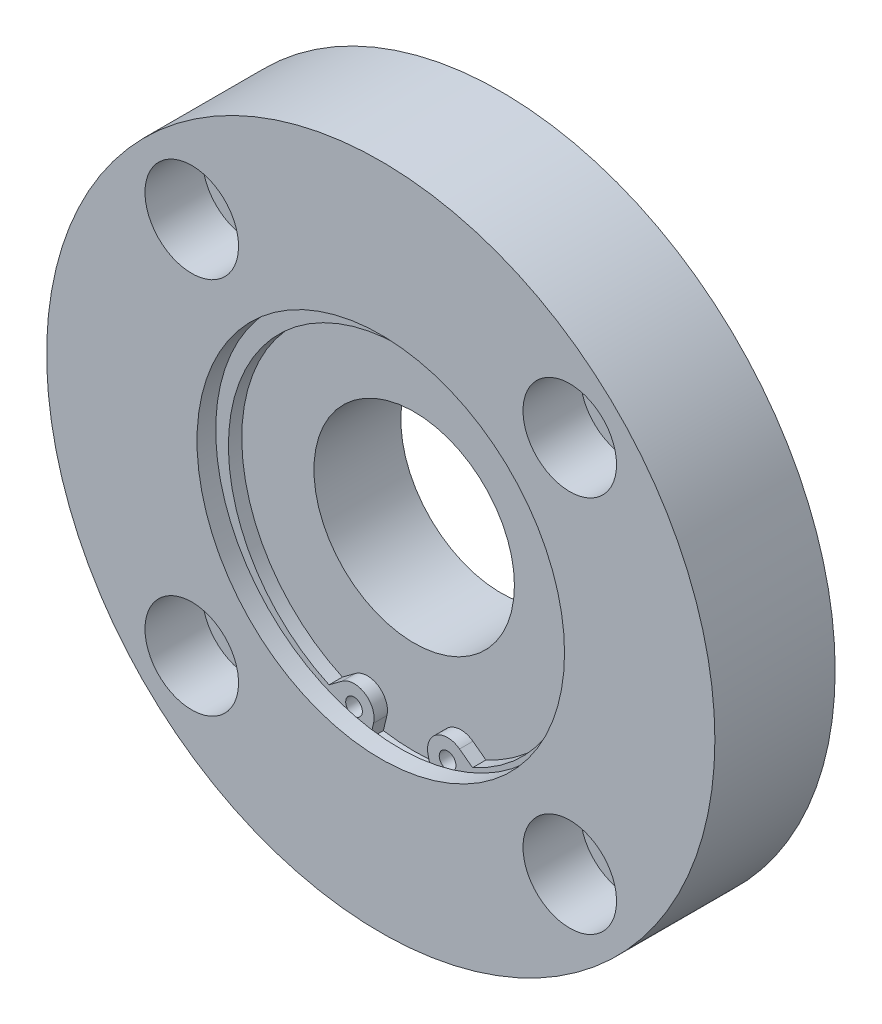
ISO-10303-21;
HEADER;
FILE_DESCRIPTION(('STEP AP214'),'2;1');
FILE_NAME('part.step','',(''),(''),'','','');
FILE_SCHEMA(('AUTOMOTIVE_DESIGN { 1 0 10303 214 1 1 1 1 }'));
ENDSEC;
DATA;
#1=APPLICATION_CONTEXT('core data for automotive mechanical design processes');
#2=APPLICATION_PROTOCOL_DEFINITION('international standard','automotive_design',2000,#1);
#3=PRODUCT_CONTEXT('',#1,'mechanical');
#4=PRODUCT('Part','Part','',(#3));
#5=PRODUCT_RELATED_PRODUCT_CATEGORY('part','',(#4));
#6=PRODUCT_DEFINITION_FORMATION('','',#4);
#7=PRODUCT_DEFINITION_CONTEXT('part definition',#1,'design');
#8=PRODUCT_DEFINITION('design','',#6,#7);
#9=PRODUCT_DEFINITION_SHAPE('','',#8);
#10=(LENGTH_UNIT() NAMED_UNIT(*) SI_UNIT(.MILLI.,.METRE.));
#11=(NAMED_UNIT(*) PLANE_ANGLE_UNIT() SI_UNIT($,.RADIAN.));
#12=(NAMED_UNIT(*) SI_UNIT($,.STERADIAN.) SOLID_ANGLE_UNIT());
#13=UNCERTAINTY_MEASURE_WITH_UNIT(LENGTH_MEASURE(1.E-05),#10,'distance_accuracy_value','');
#14=(GEOMETRIC_REPRESENTATION_CONTEXT(3) GLOBAL_UNCERTAINTY_ASSIGNED_CONTEXT((#13)) GLOBAL_UNIT_ASSIGNED_CONTEXT((#10,
#11,#12)) REPRESENTATION_CONTEXT('',''));
#15=CARTESIAN_POINT('',(0.,0.,0.));
#16=DIRECTION('',(0.,0.,1.));
#17=DIRECTION('',(1.,0.,0.));
#18=AXIS2_PLACEMENT_3D('',#15,#16,#17);
#19=CARTESIAN_POINT('',(0.,0.,13.));
#20=DIRECTION('',(0.,0.,1.));
#21=DIRECTION('',(1.,0.,0.));
#22=AXIS2_PLACEMENT_3D('',#19,#20,#21);
#23=PLANE('',#22);
#24=CARTESIAN_POINT('',(7.,-25.7166112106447,13.));
#25=DIRECTION('',(0.,0.,1.));
#26=DIRECTION('',(1.,0.,0.));
#27=AXIS2_PLACEMENT_3D('',#24,#25,#26);
#28=CIRCLE('',#27,1.25);
#29=CARTESIAN_POINT('',(8.25,-25.7166112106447,13.));
#30=VERTEX_POINT('',#29);
#31=EDGE_CURVE('E137',#30,#30,#28,.T.);
#32=ORIENTED_EDGE('',*,*,#31,.T.);
#33=EDGE_LOOP('',(#32));
#34=FACE_BOUND('',#33,.T.);
#35=ADVANCED_FACE('F14',(#34),#23,.T.);
#36=CARTESIAN_POINT('',(-7.,-25.7166112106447,13.));
#37=DIRECTION('',(0.,0.,-1.));
#38=DIRECTION('',(1.,0.,0.));
#39=AXIS2_PLACEMENT_3D('',#36,#37,#38);
#40=CIRCLE('',#39,1.25);
#41=CARTESIAN_POINT('',(-5.75,-25.7166112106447,13.));
#42=VERTEX_POINT('',#41);
#43=EDGE_CURVE('E136',#42,#42,#40,.T.);
#44=ORIENTED_EDGE('',*,*,#43,.F.);
#45=EDGE_LOOP('',(#44));
#46=FACE_BOUND('',#45,.T.);
#47=ADVANCED_FACE('F296',(#46),#23,.T.);
#48=CARTESIAN_POINT('',(28.2842712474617,28.2842712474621,0.));
#49=DIRECTION('',(0.,0.,1.));
#50=DIRECTION('',(1.,0.,0.));
#51=AXIS2_PLACEMENT_3D('',#48,#49,#50);
#52=CYLINDRICAL_SURFACE('',#51,5.);
#53=CARTESIAN_POINT('',(28.2842712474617,28.2842712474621,0.));
#54=DIRECTION('',(0.,0.,1.));
#55=DIRECTION('',(1.,0.,0.));
#56=AXIS2_PLACEMENT_3D('',#53,#54,#55);
#57=CIRCLE('',#56,5.);
#58=CARTESIAN_POINT('',(33.2842712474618,28.2842712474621,0.));
#59=VERTEX_POINT('',#58);
#60=EDGE_CURVE('E249',#59,#59,#57,.T.);
#61=ORIENTED_EDGE('',*,*,#60,.F.);
#62=EDGE_LOOP('',(#61));
#63=FACE_BOUND('',#62,.T.);
#64=CARTESIAN_POINT('',(28.2842712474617,28.2842712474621,9.4));
#65=DIRECTION('',(0.,0.,1.));
#66=DIRECTION('',(1.,0.,0.));
#67=AXIS2_PLACEMENT_3D('',#64,#65,#66);
#68=CIRCLE('',#67,5.);
#69=CARTESIAN_POINT('',(33.2842712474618,28.2842712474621,9.4));
#70=VERTEX_POINT('',#69);
#71=EDGE_CURVE('E248',#70,#70,#68,.F.);
#72=ORIENTED_EDGE('',*,*,#71,.F.);
#73=EDGE_LOOP('',(#72));
#74=FACE_BOUND('',#73,.T.);
#75=ADVANCED_FACE('F304',(#63,#74),#52,.F.);
#76=CARTESIAN_POINT('',(28.2842712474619,-28.2842712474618,0.));
#77=DIRECTION('',(0.,0.,1.));
#78=DIRECTION('',(1.,0.,0.));
#79=AXIS2_PLACEMENT_3D('',#76,#77,#78);
#80=CYLINDRICAL_SURFACE('',#79,5.);
#81=CARTESIAN_POINT('',(28.2842712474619,-28.2842712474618,0.));
#82=DIRECTION('',(0.,0.,1.));
#83=DIRECTION('',(0.,-1.,0.));
#84=AXIS2_PLACEMENT_3D('',#81,#82,#83);
#85=CIRCLE('',#84,5.);
#86=CARTESIAN_POINT('',(28.2842712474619,-33.2842712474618,0.));
#87=VERTEX_POINT('',#86);
#88=EDGE_CURVE('E239',#87,#87,#85,.T.);
#89=ORIENTED_EDGE('',*,*,#88,.F.);
#90=EDGE_LOOP('',(#89));
#91=FACE_BOUND('',#90,.T.);
#92=CARTESIAN_POINT('',(28.2842712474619,-28.2842712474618,9.4));
#93=DIRECTION('',(0.,0.,1.));
#94=DIRECTION('',(1.,0.,0.));
#95=AXIS2_PLACEMENT_3D('',#92,#93,#94);
#96=CIRCLE('',#95,5.);
#97=CARTESIAN_POINT('',(33.284271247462,-28.2842712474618,9.4));
#98=VERTEX_POINT('',#97);
#99=EDGE_CURVE('E232',#98,#98,#96,.F.);
#100=ORIENTED_EDGE('',*,*,#99,.F.);
#101=EDGE_LOOP('',(#100));
#102=FACE_BOUND('',#101,.T.);
#103=ADVANCED_FACE('F630',(#91,#102),#80,.F.);
#104=CARTESIAN_POINT('',(-28.2842712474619,-28.2842712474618,0.));
#105=DIRECTION('',(0.,0.,1.));
#106=DIRECTION('',(1.,0.,0.));
#107=AXIS2_PLACEMENT_3D('',#104,#105,#106);
#108=CYLINDRICAL_SURFACE('',#107,5.);
#109=CARTESIAN_POINT('',(-28.2842712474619,-28.2842712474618,0.));
#110=DIRECTION('',(0.,0.,1.));
#111=DIRECTION('',(-1.,0.,0.));
#112=AXIS2_PLACEMENT_3D('',#109,#110,#111);
#113=CIRCLE('',#112,5.);
#114=CARTESIAN_POINT('',(-33.284271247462,-28.2842712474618,0.));
#115=VERTEX_POINT('',#114);
#116=EDGE_CURVE('E236',#115,#115,#113,.T.);
#117=ORIENTED_EDGE('',*,*,#116,.F.);
#118=EDGE_LOOP('',(#117));
#119=FACE_BOUND('',#118,.T.);
#120=CARTESIAN_POINT('',(-28.2842712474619,-28.2842712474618,9.4));
#121=DIRECTION('',(0.,0.,1.));
#122=DIRECTION('',(1.,0.,0.));
#123=AXIS2_PLACEMENT_3D('',#120,#121,#122);
#124=CIRCLE('',#123,5.);
#125=CARTESIAN_POINT('',(-23.2842712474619,-28.2842712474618,9.4));
#126=VERTEX_POINT('',#125);
#127=EDGE_CURVE('E225',#126,#126,#124,.F.);
#128=ORIENTED_EDGE('',*,*,#127,.F.);
#129=EDGE_LOOP('',(#128));
#130=FACE_BOUND('',#129,.T.);
#131=ADVANCED_FACE('F620',(#119,#130),#108,.F.);
#132=CARTESIAN_POINT('',(-28.2842712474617,28.2842712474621,0.));
#133=DIRECTION('',(0.,0.,1.));
#134=DIRECTION('',(1.,0.,0.));
#135=AXIS2_PLACEMENT_3D('',#132,#133,#134);
#136=CYLINDRICAL_SURFACE('',#135,5.);
#137=CARTESIAN_POINT('',(-28.2842712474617,28.2842712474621,0.));
#138=DIRECTION('',(0.,0.,1.));
#139=DIRECTION('',(0.,1.,0.));
#140=AXIS2_PLACEMENT_3D('',#137,#138,#139);
#141=CIRCLE('',#140,5.);
#142=CARTESIAN_POINT('',(-28.2842712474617,33.2842712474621,0.));
#143=VERTEX_POINT('',#142);
#144=EDGE_CURVE('E233',#143,#143,#141,.T.);
#145=ORIENTED_EDGE('',*,*,#144,.F.);
#146=EDGE_LOOP('',(#145));
#147=FACE_BOUND('',#146,.T.);
#148=CARTESIAN_POINT('',(-28.2842712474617,28.2842712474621,9.4));
#149=DIRECTION('',(0.,0.,1.));
#150=DIRECTION('',(1.,0.,0.));
#151=AXIS2_PLACEMENT_3D('',#148,#149,#150);
#152=CIRCLE('',#151,5.);
#153=CARTESIAN_POINT('',(-23.2842712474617,28.2842712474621,9.4));
#154=VERTEX_POINT('',#153);
#155=EDGE_CURVE('E218',#154,#154,#152,.F.);
#156=ORIENTED_EDGE('',*,*,#155,.F.);
#157=EDGE_LOOP('',(#156));
#158=FACE_BOUND('',#157,.T.);
#159=ADVANCED_FACE('F611',(#147,#158),#136,.F.);
#160=CARTESIAN_POINT('',(0.,0.,0.));
#161=DIRECTION('',(0.,0.,1.));
#162=DIRECTION('',(1.,0.,0.));
#163=AXIS2_PLACEMENT_3D('',#160,#161,#162);
#164=PLANE('',#163);
#165=ORIENTED_EDGE('',*,*,#144,.T.);
#166=EDGE_LOOP('',(#165));
#167=FACE_BOUND('',#166,.T.);
#168=ORIENTED_EDGE('',*,*,#116,.T.);
#169=EDGE_LOOP('',(#168));
#170=FACE_BOUND('',#169,.T.);
#171=ORIENTED_EDGE('',*,*,#88,.T.);
#172=EDGE_LOOP('',(#171));
#173=FACE_BOUND('',#172,.T.);
#174=ORIENTED_EDGE('',*,*,#60,.T.);
#175=EDGE_LOOP('',(#174));
#176=FACE_BOUND('',#175,.T.);
#177=CARTESIAN_POINT('',(0.,0.,0.));
#178=DIRECTION('',(0.,0.,1.));
#179=DIRECTION('',(1.,0.,0.));
#180=AXIS2_PLACEMENT_3D('',#177,#178,#179);
#181=CIRCLE('',#180,50.);
#182=CARTESIAN_POINT('',(50.,0.,0.));
#183=VERTEX_POINT('',#182);
#184=EDGE_CURVE('E255',#183,#183,#181,.T.);
#185=ORIENTED_EDGE('',*,*,#184,.F.);
#186=EDGE_LOOP('',(#185));
#187=FACE_BOUND('',#186,.T.);
#188=CARTESIAN_POINT('',(0.,0.,0.));
#189=DIRECTION('',(0.,0.,-1.));
#190=DIRECTION('',(-1.,0.,0.));
#191=AXIS2_PLACEMENT_3D('',#188,#189,#190);
#192=CIRCLE('',#191,31.);
#193=CARTESIAN_POINT('',(-31.,0.,0.));
#194=VERTEX_POINT('',#193);
#195=EDGE_CURVE('E147',#194,#194,#192,.T.);
#196=ORIENTED_EDGE('',*,*,#195,.F.);
#197=EDGE_LOOP('',(#196));
#198=FACE_BOUND('',#197,.T.);
#199=ADVANCED_FACE('F292',(#167,#170,#173,#176,#187,#198),#164,.F.);
#200=CARTESIAN_POINT('',(28.2842712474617,28.2842712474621,9.4));
#201=DIRECTION('',(0.,0.,1.));
#202=DIRECTION('',(1.,0.,0.));
#203=AXIS2_PLACEMENT_3D('',#200,#201,#202);
#204=PLANE('',#203);
#205=CARTESIAN_POINT('',(28.2842712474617,28.2842712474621,9.4));
#206=DIRECTION('',(0.,0.,1.));
#207=DIRECTION('',(1.,0.,0.));
#208=AXIS2_PLACEMENT_3D('',#205,#206,#207);
#209=CIRCLE('',#208,7.);
#210=CARTESIAN_POINT('',(35.2842712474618,28.2842712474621,9.4));
#211=VERTEX_POINT('',#210);
#212=EDGE_CURVE('E245',#211,#211,#209,.T.);
#213=ORIENTED_EDGE('',*,*,#212,.T.);
#214=EDGE_LOOP('',(#213));
#215=FACE_BOUND('',#214,.T.);
#216=ORIENTED_EDGE('',*,*,#71,.T.);
#217=EDGE_LOOP('',(#216));
#218=FACE_BOUND('',#217,.T.);
#219=ADVANCED_FACE('F592',(#215,#218),#204,.T.);
#220=CARTESIAN_POINT('',(28.2842712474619,-28.2842712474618,9.4));
#221=DIRECTION('',(0.,0.,1.));
#222=DIRECTION('',(0.,-1.,0.));
#223=AXIS2_PLACEMENT_3D('',#220,#221,#222);
#224=PLANE('',#223);
#225=CARTESIAN_POINT('',(28.2842712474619,-28.2842712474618,9.4));
#226=DIRECTION('',(0.,0.,1.));
#227=DIRECTION('',(0.,-1.,0.));
#228=AXIS2_PLACEMENT_3D('',#225,#226,#227);
#229=CIRCLE('',#228,7.);
#230=CARTESIAN_POINT('',(28.2842712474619,-35.2842712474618,9.4));
#231=VERTEX_POINT('',#230);
#232=EDGE_CURVE('E229',#231,#231,#229,.T.);
#233=ORIENTED_EDGE('',*,*,#232,.T.);
#234=EDGE_LOOP('',(#233));
#235=FACE_BOUND('',#234,.T.);
#236=ORIENTED_EDGE('',*,*,#99,.T.);
#237=EDGE_LOOP('',(#236));
#238=FACE_BOUND('',#237,.T.);
#239=ADVANCED_FACE('F582',(#235,#238),#224,.T.);
#240=CARTESIAN_POINT('',(-28.2842712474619,-28.2842712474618,9.4));
#241=DIRECTION('',(0.,0.,1.));
#242=DIRECTION('',(-1.,0.,0.));
#243=AXIS2_PLACEMENT_3D('',#240,#241,#242);
#244=PLANE('',#243);
#245=CARTESIAN_POINT('',(-28.2842712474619,-28.2842712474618,9.4));
#246=DIRECTION('',(0.,0.,1.));
#247=DIRECTION('',(-1.,0.,0.));
#248=AXIS2_PLACEMENT_3D('',#245,#246,#247);
#249=CIRCLE('',#248,7.);
#250=CARTESIAN_POINT('',(-35.284271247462,-28.2842712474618,9.4));
#251=VERTEX_POINT('',#250);
#252=EDGE_CURVE('E222',#251,#251,#249,.T.);
#253=ORIENTED_EDGE('',*,*,#252,.T.);
#254=EDGE_LOOP('',(#253));
#255=FACE_BOUND('',#254,.T.);
#256=ORIENTED_EDGE('',*,*,#127,.T.);
#257=EDGE_LOOP('',(#256));
#258=FACE_BOUND('',#257,.T.);
#259=ADVANCED_FACE('F572',(#255,#258),#244,.T.);
#260=CARTESIAN_POINT('',(-28.2842712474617,28.2842712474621,9.4));
#261=DIRECTION('',(0.,0.,1.));
#262=DIRECTION('',(0.,1.,0.));
#263=AXIS2_PLACEMENT_3D('',#260,#261,#262);
#264=PLANE('',#263);
#265=CARTESIAN_POINT('',(-28.2842712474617,28.2842712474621,9.4));
#266=DIRECTION('',(0.,0.,1.));
#267=DIRECTION('',(0.,1.,0.));
#268=AXIS2_PLACEMENT_3D('',#265,#266,#267);
#269=CIRCLE('',#268,7.);
#270=CARTESIAN_POINT('',(-28.2842712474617,35.2842712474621,9.4));
#271=VERTEX_POINT('',#270);
#272=EDGE_CURVE('E215',#271,#271,#269,.T.);
#273=ORIENTED_EDGE('',*,*,#272,.T.);
#274=EDGE_LOOP('',(#273));
#275=FACE_BOUND('',#274,.T.);
#276=ORIENTED_EDGE('',*,*,#155,.T.);
#277=EDGE_LOOP('',(#276));
#278=FACE_BOUND('',#277,.T.);
#279=ADVANCED_FACE('F563',(#275,#278),#264,.T.);
#280=CARTESIAN_POINT('',(0.,0.,-5.));
#281=DIRECTION('',(0.,0.,1.));
#282=DIRECTION('',(1.,0.,0.));
#283=AXIS2_PLACEMENT_3D('',#280,#281,#282);
#284=CYLINDRICAL_SURFACE('',#283,31.);
#285=CARTESIAN_POINT('',(0.,0.,-5.));
#286=DIRECTION('',(0.,0.,-1.));
#287=DIRECTION('',(-1.,0.,0.));
#288=AXIS2_PLACEMENT_3D('',#285,#286,#287);
#289=CIRCLE('',#288,31.);
#290=CARTESIAN_POINT('',(-31.,0.,-5.));
#291=VERTEX_POINT('',#290);
#292=EDGE_CURVE('E202',#291,#291,#289,.T.);
#293=ORIENTED_EDGE('',*,*,#292,.F.);
#294=EDGE_LOOP('',(#293));
#295=FACE_BOUND('',#294,.T.);
#296=ORIENTED_EDGE('',*,*,#195,.T.);
#297=EDGE_LOOP('',(#296));
#298=FACE_BOUND('',#297,.T.);
#299=ADVANCED_FACE('F554',(#295,#298),#284,.T.);
#300=CARTESIAN_POINT('',(0.,0.,18.));
#301=DIRECTION('',(0.,0.,-1.));
#302=DIRECTION('',(-1.,0.,0.));
#303=AXIS2_PLACEMENT_3D('',#300,#301,#302);
#304=CYLINDRICAL_SURFACE('',#303,50.);
#305=CARTESIAN_POINT('',(0.,0.,18.));
#306=DIRECTION('',(0.,0.,1.));
#307=DIRECTION('',(1.,0.,0.));
#308=AXIS2_PLACEMENT_3D('',#305,#306,#307);
#309=CIRCLE('',#308,50.);
#310=CARTESIAN_POINT('',(50.,0.,18.));
#311=VERTEX_POINT('',#310);
#312=EDGE_CURVE('E205',#311,#311,#309,.T.);
#313=ORIENTED_EDGE('',*,*,#312,.F.);
#314=EDGE_LOOP('',(#313));
#315=FACE_BOUND('',#314,.T.);
#316=ORIENTED_EDGE('',*,*,#184,.T.);
#317=EDGE_LOOP('',(#316));
#318=FACE_BOUND('',#317,.T.);
#319=ADVANCED_FACE('F16',(#315,#318),#304,.T.);
#320=CARTESIAN_POINT('',(28.2842712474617,28.2842712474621,9.4));
#321=DIRECTION('',(0.,0.,1.));
#322=DIRECTION('',(1.,0.,0.));
#323=AXIS2_PLACEMENT_3D('',#320,#321,#322);
#324=CYLINDRICAL_SURFACE('',#323,7.);
#325=ORIENTED_EDGE('',*,*,#212,.F.);
#326=EDGE_LOOP('',(#325));
#327=FACE_BOUND('',#326,.T.);
#328=CARTESIAN_POINT('',(28.2842712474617,28.2842712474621,18.));
#329=DIRECTION('',(0.,0.,1.));
#330=DIRECTION('',(1.,0.,0.));
#331=AXIS2_PLACEMENT_3D('',#328,#329,#330);
#332=CIRCLE('',#331,7.);
#333=CARTESIAN_POINT('',(35.2842712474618,28.2842712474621,18.));
#334=VERTEX_POINT('',#333);
#335=EDGE_CURVE('E242',#334,#334,#332,.T.);
#336=ORIENTED_EDGE('',*,*,#335,.T.);
#337=EDGE_LOOP('',(#336));
#338=FACE_BOUND('',#337,.T.);
#339=ADVANCED_FACE('F535',(#327,#338),#324,.F.);
#340=CARTESIAN_POINT('',(28.2842712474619,-28.2842712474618,9.4));
#341=DIRECTION('',(0.,0.,1.));
#342=DIRECTION('',(1.,0.,0.));
#343=AXIS2_PLACEMENT_3D('',#340,#341,#342);
#344=CYLINDRICAL_SURFACE('',#343,7.);
#345=ORIENTED_EDGE('',*,*,#232,.F.);
#346=EDGE_LOOP('',(#345));
#347=FACE_BOUND('',#346,.T.);
#348=CARTESIAN_POINT('',(28.2842712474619,-28.2842712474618,18.));
#349=DIRECTION('',(0.,0.,1.));
#350=DIRECTION('',(0.,-1.,0.));
#351=AXIS2_PLACEMENT_3D('',#348,#349,#350);
#352=CIRCLE('',#351,7.);
#353=CARTESIAN_POINT('',(28.2842712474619,-35.2842712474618,18.));
#354=VERTEX_POINT('',#353);
#355=EDGE_CURVE('E226',#354,#354,#352,.T.);
#356=ORIENTED_EDGE('',*,*,#355,.T.);
#357=EDGE_LOOP('',(#356));
#358=FACE_BOUND('',#357,.T.);
#359=ADVANCED_FACE('F525',(#347,#358),#344,.F.);
#360=CARTESIAN_POINT('',(-28.2842712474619,-28.2842712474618,9.4));
#361=DIRECTION('',(0.,0.,1.));
#362=DIRECTION('',(1.,0.,0.));
#363=AXIS2_PLACEMENT_3D('',#360,#361,#362);
#364=CYLINDRICAL_SURFACE('',#363,7.);
#365=ORIENTED_EDGE('',*,*,#252,.F.);
#366=EDGE_LOOP('',(#365));
#367=FACE_BOUND('',#366,.T.);
#368=CARTESIAN_POINT('',(-28.2842712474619,-28.2842712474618,18.));
#369=DIRECTION('',(0.,0.,1.));
#370=DIRECTION('',(-1.,0.,0.));
#371=AXIS2_PLACEMENT_3D('',#368,#369,#370);
#372=CIRCLE('',#371,7.);
#373=CARTESIAN_POINT('',(-35.284271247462,-28.2842712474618,18.));
#374=VERTEX_POINT('',#373);
#375=EDGE_CURVE('E219',#374,#374,#372,.T.);
#376=ORIENTED_EDGE('',*,*,#375,.T.);
#377=EDGE_LOOP('',(#376));
#378=FACE_BOUND('',#377,.T.);
#379=ADVANCED_FACE('F515',(#367,#378),#364,.F.);
#380=CARTESIAN_POINT('',(-28.2842712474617,28.2842712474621,9.4));
#381=DIRECTION('',(0.,0.,1.));
#382=DIRECTION('',(1.,0.,0.));
#383=AXIS2_PLACEMENT_3D('',#380,#381,#382);
#384=CYLINDRICAL_SURFACE('',#383,7.);
#385=ORIENTED_EDGE('',*,*,#272,.F.);
#386=EDGE_LOOP('',(#385));
#387=FACE_BOUND('',#386,.T.);
#388=CARTESIAN_POINT('',(-28.2842712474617,28.2842712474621,18.));
#389=DIRECTION('',(0.,0.,1.));
#390=DIRECTION('',(0.,1.,0.));
#391=AXIS2_PLACEMENT_3D('',#388,#389,#390);
#392=CIRCLE('',#391,7.);
#393=CARTESIAN_POINT('',(-28.2842712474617,35.2842712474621,18.));
#394=VERTEX_POINT('',#393);
#395=EDGE_CURVE('E212',#394,#394,#392,.T.);
#396=ORIENTED_EDGE('',*,*,#395,.T.);
#397=EDGE_LOOP('',(#396));
#398=FACE_BOUND('',#397,.T.);
#399=ADVANCED_FACE('F505',(#387,#398),#384,.F.);
#400=CARTESIAN_POINT('',(0.,0.,-5.));
#401=DIRECTION('',(0.,0.,-1.));
#402=DIRECTION('',(-1.,0.,0.));
#403=AXIS2_PLACEMENT_3D('',#400,#401,#402);
#404=PLANE('',#403);
#405=ORIENTED_EDGE('',*,*,#292,.T.);
#406=EDGE_LOOP('',(#405));
#407=FACE_BOUND('',#406,.T.);
#408=CARTESIAN_POINT('',(0.,0.,-5.));
#409=DIRECTION('',(0.,0.,-1.));
#410=DIRECTION('',(-1.,0.,0.));
#411=AXIS2_PLACEMENT_3D('',#408,#409,#410);
#412=CIRCLE('',#411,24.);
#413=CARTESIAN_POINT('',(-24.,0.,-5.));
#414=VERTEX_POINT('',#413);
#415=EDGE_CURVE('E199',#414,#414,#412,.T.);
#416=ORIENTED_EDGE('',*,*,#415,.F.);
#417=EDGE_LOOP('',(#416));
#418=FACE_BOUND('',#417,.T.);
#419=ADVANCED_FACE('F496',(#407,#418),#404,.T.);
#420=CARTESIAN_POINT('',(0.,0.,18.));
#421=DIRECTION('',(0.,0.,1.));
#422=DIRECTION('',(1.,0.,0.));
#423=AXIS2_PLACEMENT_3D('',#420,#421,#422);
#424=PLANE('',#423);
#425=CARTESIAN_POINT('',(0.,0.,18.));
#426=DIRECTION('',(0.,0.,1.));
#427=DIRECTION('',(1.,0.,0.));
#428=AXIS2_PLACEMENT_3D('',#425,#426,#427);
#429=CIRCLE('',#428,27.5);
#430=CARTESIAN_POINT('',(27.5,0.,18.));
#431=VERTEX_POINT('',#430);
#432=EDGE_CURVE('E208',#431,#431,#429,.T.);
#433=ORIENTED_EDGE('',*,*,#432,.F.);
#434=EDGE_LOOP('',(#433));
#435=FACE_BOUND('',#434,.T.);
#436=ORIENTED_EDGE('',*,*,#395,.F.);
#437=EDGE_LOOP('',(#436));
#438=FACE_BOUND('',#437,.T.);
#439=ORIENTED_EDGE('',*,*,#375,.F.);
#440=EDGE_LOOP('',(#439));
#441=FACE_BOUND('',#440,.T.);
#442=ORIENTED_EDGE('',*,*,#355,.F.);
#443=EDGE_LOOP('',(#442));
#444=FACE_BOUND('',#443,.T.);
#445=ORIENTED_EDGE('',*,*,#335,.F.);
#446=EDGE_LOOP('',(#445));
#447=FACE_BOUND('',#446,.T.);
#448=ORIENTED_EDGE('',*,*,#312,.T.);
#449=EDGE_LOOP('',(#448));
#450=FACE_BOUND('',#449,.T.);
#451=ADVANCED_FACE('F486',(#435,#438,#441,#444,#447,#450),#424,.T.);
#452=CARTESIAN_POINT('',(0.,0.,-5.));
#453=DIRECTION('',(0.,0.,1.));
#454=DIRECTION('',(1.,0.,0.));
#455=AXIS2_PLACEMENT_3D('',#452,#453,#454);
#456=CYLINDRICAL_SURFACE('',#455,24.);
#457=ORIENTED_EDGE('',*,*,#415,.T.);
#458=EDGE_LOOP('',(#457));
#459=FACE_BOUND('',#458,.T.);
#460=CARTESIAN_POINT('',(0.,0.,0.));
#461=DIRECTION('',(0.,0.,-1.));
#462=DIRECTION('',(-1.,0.,0.));
#463=AXIS2_PLACEMENT_3D('',#460,#461,#462);
#464=CIRCLE('',#463,24.);
#465=CARTESIAN_POINT('',(-24.,0.,0.));
#466=VERTEX_POINT('',#465);
#467=EDGE_CURVE('E196',#466,#466,#464,.T.);
#468=ORIENTED_EDGE('',*,*,#467,.F.);
#469=EDGE_LOOP('',(#468));
#470=FACE_BOUND('',#469,.T.);
#471=ADVANCED_FACE('F478',(#459,#470),#456,.F.);
#472=CARTESIAN_POINT('',(0.,0.,13.));
#473=DIRECTION('',(0.,0.,1.));
#474=DIRECTION('',(1.,0.,0.));
#475=AXIS2_PLACEMENT_3D('',#472,#473,#474);
#476=CYLINDRICAL_SURFACE('',#475,27.5);
#477=CARTESIAN_POINT('',(0.,0.,15.2));
#478=DIRECTION('',(0.,0.,1.));
#479=DIRECTION('',(1.,0.,0.));
#480=AXIS2_PLACEMENT_3D('',#477,#478,#479);
#481=CIRCLE('',#480,27.5);
#482=CARTESIAN_POINT('',(27.5,0.,15.2));
#483=VERTEX_POINT('',#482);
#484=EDGE_CURVE('E192',#483,#483,#481,.F.);
#485=ORIENTED_EDGE('',*,*,#484,.T.);
#486=EDGE_LOOP('',(#485));
#487=FACE_BOUND('',#486,.T.);
#488=ORIENTED_EDGE('',*,*,#432,.T.);
#489=EDGE_LOOP('',(#488));
#490=FACE_BOUND('',#489,.T.);
#491=ADVANCED_FACE('F273',(#487,#490),#476,.F.);
#492=ORIENTED_EDGE('',*,*,#467,.T.);
#493=EDGE_LOOP('',(#492));
#494=FACE_BOUND('',#493,.T.);
#495=CARTESIAN_POINT('',(0.,0.,0.));
#496=DIRECTION('',(0.,0.,1.));
#497=DIRECTION('',(1.,0.,0.));
#498=AXIS2_PLACEMENT_3D('',#495,#496,#497);
#499=CIRCLE('',#498,15.);
#500=CARTESIAN_POINT('',(15.,0.,0.));
#501=VERTEX_POINT('',#500);
#502=EDGE_CURVE('E252',#501,#501,#499,.T.);
#503=ORIENTED_EDGE('',*,*,#502,.T.);
#504=EDGE_LOOP('',(#503));
#505=FACE_BOUND('',#504,.T.);
#506=ADVANCED_FACE('F279',(#494,#505),#164,.F.);
#507=CARTESIAN_POINT('',(0.,0.,15.2));
#508=DIRECTION('',(0.,0.,1.));
#509=DIRECTION('',(1.,0.,0.));
#510=AXIS2_PLACEMENT_3D('',#507,#508,#509);
#511=PLANE('',#510);
#512=CARTESIAN_POINT('',(0.,0.,15.2));
#513=DIRECTION('',(0.,0.,1.));
#514=DIRECTION('',(1.,0.,0.));
#515=AXIS2_PLACEMENT_3D('',#512,#513,#514);
#516=CIRCLE('',#515,29.);
#517=CARTESIAN_POINT('',(29.,0.,15.2));
#518=VERTEX_POINT('',#517);
#519=EDGE_CURVE('E189',#518,#518,#516,.T.);
#520=ORIENTED_EDGE('',*,*,#519,.F.);
#521=EDGE_LOOP('',(#520));
#522=FACE_BOUND('',#521,.T.);
#523=ORIENTED_EDGE('',*,*,#484,.F.);
#524=EDGE_LOOP('',(#523));
#525=FACE_BOUND('',#524,.T.);
#526=ADVANCED_FACE('F276',(#522,#525),#511,.F.);
#527=CARTESIAN_POINT('',(0.,0.,15.2));
#528=DIRECTION('',(0.,0.,-1.));
#529=DIRECTION('',(-1.,0.,0.));
#530=AXIS2_PLACEMENT_3D('',#527,#528,#529);
#531=CYLINDRICAL_SURFACE('',#530,29.);
#532=ORIENTED_EDGE('',*,*,#519,.T.);
#533=EDGE_LOOP('',(#532));
#534=FACE_BOUND('',#533,.T.);
#535=DIRECTION('',(0.,0.,-1.));
#536=VECTOR('',#535,1.);
#537=CARTESIAN_POINT('',(4.60946385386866,-28.6313262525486,15.2));
#538=LINE('',#537,#536);
#539=CARTESIAN_POINT('',(4.60946385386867,-28.6313262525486,13.));
#540=VERTEX_POINT('',#539);
#541=CARTESIAN_POINT('',(4.60946385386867,-28.6313262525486,15.));
#542=VERTEX_POINT('',#541);
#543=EDGE_CURVE('E18',#540,#542,#538,.F.);
#544=ORIENTED_EDGE('',*,*,#543,.F.);
#545=CARTESIAN_POINT('',(0.,0.,13.));
#546=DIRECTION('',(0.,0.,1.));
#547=DIRECTION('',(1.,0.,0.));
#548=AXIS2_PLACEMENT_3D('',#545,#546,#547);
#549=CIRCLE('',#548,29.);
#550=CARTESIAN_POINT('',(-4.60946385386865,-28.6313262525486,13.));
#551=VERTEX_POINT('',#550);
#552=EDGE_CURVE('E193',#551,#540,#549,.T.);
#553=ORIENTED_EDGE('',*,*,#552,.F.);
#554=DIRECTION('',(0.,0.,-1.));
#555=VECTOR('',#554,1.);
#556=CARTESIAN_POINT('',(-4.60946385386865,-28.6313262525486,15.2));
#557=LINE('',#556,#555);
#558=CARTESIAN_POINT('',(-4.60946385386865,-28.6313262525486,15.));
#559=VERTEX_POINT('',#558);
#560=EDGE_CURVE('E183',#559,#551,#557,.T.);
#561=ORIENTED_EDGE('',*,*,#560,.F.);
#562=CARTESIAN_POINT('',(0.,0.,15.));
#563=DIRECTION('',(0.,0.,-1.));
#564=DIRECTION('',(-1.,0.,0.));
#565=AXIS2_PLACEMENT_3D('',#562,#563,#564);
#566=CIRCLE('',#565,29.);
#567=EDGE_CURVE('E9',#542,#559,#566,.F.);
#568=ORIENTED_EDGE('',*,*,#567,.F.);
#569=EDGE_LOOP('',(#544,#553,#561,#568));
#570=FACE_BOUND('',#569,.T.);
#571=ADVANCED_FACE('F278',(#534,#570),#531,.F.);
#572=CARTESIAN_POINT('',(0.,0.,18.));
#573=DIRECTION('',(0.,0.,-1.));
#574=DIRECTION('',(-1.,0.,0.));
#575=AXIS2_PLACEMENT_3D('',#572,#573,#574);
#576=CYLINDRICAL_SURFACE('',#575,15.);
#577=ORIENTED_EDGE('',*,*,#502,.F.);
#578=EDGE_LOOP('',(#577));
#579=FACE_BOUND('',#578,.T.);
#580=CARTESIAN_POINT('',(0.,0.,13.));
#581=DIRECTION('',(0.,0.,1.));
#582=DIRECTION('',(1.,0.,0.));
#583=AXIS2_PLACEMENT_3D('',#580,#581,#582);
#584=CIRCLE('',#583,15.);
#585=CARTESIAN_POINT('',(15.,0.,13.));
#586=VERTEX_POINT('',#585);
#587=EDGE_CURVE('E211',#586,#586,#584,.T.);
#588=ORIENTED_EDGE('',*,*,#587,.T.);
#589=EDGE_LOOP('',(#588));
#590=FACE_BOUND('',#589,.T.);
#591=ADVANCED_FACE('F287',(#579,#590),#576,.F.);
#592=ORIENTED_EDGE('',*,*,#587,.F.);
#593=EDGE_LOOP('',(#592));
#594=FACE_BOUND('',#593,.T.);
#595=DIRECTION('',(0.231349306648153,-0.972870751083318,0.));
#596=VECTOR('',#595,1.);
#597=CARTESIAN_POINT('',(4.08138774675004,-26.4106591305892,13.));
#598=LINE('',#597,#596);
#599=CARTESIAN_POINT('',(4.08138774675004,-26.4106591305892,13.));
#600=VERTEX_POINT('',#599);
#601=EDGE_CURVE('E34',#600,#540,#598,.T.);
#602=ORIENTED_EDGE('',*,*,#601,.F.);
#603=CARTESIAN_POINT('',(7.,-25.7166112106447,13.));
#604=DIRECTION('',(0.,0.,1.));
#605=DIRECTION('',(1.,0.,0.));
#606=AXIS2_PLACEMENT_3D('',#603,#604,#605);
#607=CIRCLE('',#606,3.);
#608=CARTESIAN_POINT('',(8.7896612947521,-23.3088918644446,13.));
#609=VERTEX_POINT('',#608);
#610=EDGE_CURVE('E112',#609,#600,#607,.T.);
#611=ORIENTED_EDGE('',*,*,#610,.F.);
#612=DIRECTION('',(-0.802573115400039,0.596553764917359,0.));
#613=VECTOR('',#612,1.);
#614=CARTESIAN_POINT('',(8.7896612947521,-23.3088918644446,13.));
#615=LINE('',#614,#613);
#616=CARTESIAN_POINT('',(10.7397756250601,-24.7584146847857,13.));
#617=VERTEX_POINT('',#616);
#618=EDGE_CURVE('E127',#617,#609,#615,.T.);
#619=ORIENTED_EDGE('',*,*,#618,.F.);
#620=CARTESIAN_POINT('',(0.,-1.3,13.));
#621=DIRECTION('',(0.,0.,-1.));
#622=DIRECTION('',(0.,-1.,0.));
#623=AXIS2_PLACEMENT_3D('',#620,#621,#622);
#624=CIRCLE('',#623,25.8);
#625=CARTESIAN_POINT('',(-10.7397756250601,-24.7584146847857,13.));
#626=VERTEX_POINT('',#625);
#627=EDGE_CURVE('E142',#626,#617,#624,.T.);
#628=ORIENTED_EDGE('',*,*,#627,.F.);
#629=DIRECTION('',(-0.802573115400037,-0.596553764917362,0.));
#630=VECTOR('',#629,1.);
#631=CARTESIAN_POINT('',(-8.7896612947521,-23.3088918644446,13.));
#632=LINE('',#631,#630);
#633=CARTESIAN_POINT('',(-8.7896612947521,-23.3088918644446,13.));
#634=VERTEX_POINT('',#633);
#635=EDGE_CURVE('E159',#634,#626,#632,.T.);
#636=ORIENTED_EDGE('',*,*,#635,.F.);
#637=CARTESIAN_POINT('',(-7.,-25.7166112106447,13.));
#638=DIRECTION('',(0.,0.,1.));
#639=DIRECTION('',(-1.,0.,0.));
#640=AXIS2_PLACEMENT_3D('',#637,#638,#639);
#641=CIRCLE('',#640,3.);
#642=CARTESIAN_POINT('',(-4.08138774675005,-26.4106591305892,13.));
#643=VERTEX_POINT('',#642);
#644=EDGE_CURVE('E123',#643,#634,#641,.T.);
#645=ORIENTED_EDGE('',*,*,#644,.F.);
#646=DIRECTION('',(0.231349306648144,0.97287075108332,0.));
#647=VECTOR('',#646,1.);
#648=CARTESIAN_POINT('',(-4.08138774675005,-26.4106591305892,13.));
#649=LINE('',#648,#647);
#650=EDGE_CURVE('E114',#551,#643,#649,.T.);
#651=ORIENTED_EDGE('',*,*,#650,.F.);
#652=ORIENTED_EDGE('',*,*,#552,.T.);
#653=EDGE_LOOP('',(#602,#611,#619,#628,#636,#645,#651,#652));
#654=FACE_BOUND('',#653,.T.);
#655=ADVANCED_FACE('F299',(#594,#654),#23,.T.);
#656=CARTESIAN_POINT('',(0.,-1.3,15.));
#657=DIRECTION('',(0.,0.,1.));
#658=DIRECTION('',(-1.,0.,0.));
#659=AXIS2_PLACEMENT_3D('',#656,#657,#658);
#660=CYLINDRICAL_SURFACE('',#659,25.8);
#661=ORIENTED_EDGE('',*,*,#627,.T.);
#662=DIRECTION('',(0.,0.,-1.));
#663=VECTOR('',#662,1.);
#664=CARTESIAN_POINT('',(10.7397756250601,-24.7584146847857,15.));
#665=LINE('',#664,#663);
#666=CARTESIAN_POINT('',(10.7397756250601,-24.7584146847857,15.));
#667=VERTEX_POINT('',#666);
#668=EDGE_CURVE('E151',#667,#617,#665,.T.);
#669=ORIENTED_EDGE('',*,*,#668,.F.);
#670=CARTESIAN_POINT('',(0.,-1.3,15.));
#671=DIRECTION('',(0.,0.,-1.));
#672=DIRECTION('',(0.,-1.,0.));
#673=AXIS2_PLACEMENT_3D('',#670,#671,#672);
#674=CIRCLE('',#673,25.8);
#675=CARTESIAN_POINT('',(-10.7397756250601,-24.7584146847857,15.));
#676=VERTEX_POINT('',#675);
#677=EDGE_CURVE('E152',#676,#667,#674,.T.);
#678=ORIENTED_EDGE('',*,*,#677,.F.);
#679=DIRECTION('',(0.,0.,-1.));
#680=VECTOR('',#679,1.);
#681=CARTESIAN_POINT('',(-10.7397756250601,-24.7584146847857,15.));
#682=LINE('',#681,#680);
#683=EDGE_CURVE('E155',#676,#626,#682,.T.);
#684=ORIENTED_EDGE('',*,*,#683,.T.);
#685=EDGE_LOOP('',(#661,#669,#678,#684));
#686=FACE_BOUND('',#685,.T.);
#687=ADVANCED_FACE('F300',(#686),#660,.F.);
#688=CARTESIAN_POINT('',(8.7896612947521,-23.3088918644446,15.));
#689=DIRECTION('',(-0.596553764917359,-0.802573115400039,0.));
#690=DIRECTION('',(-0.802573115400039,0.596553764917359,0.));
#691=AXIS2_PLACEMENT_3D('',#688,#689,#690);
#692=PLANE('',#691);
#693=ORIENTED_EDGE('',*,*,#618,.T.);
#694=DIRECTION('',(0.,0.,-1.));
#695=VECTOR('',#694,1.);
#696=CARTESIAN_POINT('',(8.7896612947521,-23.3088918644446,15.));
#697=LINE('',#696,#695);
#698=CARTESIAN_POINT('',(8.7896612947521,-23.3088918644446,15.));
#699=VERTEX_POINT('',#698);
#700=EDGE_CURVE('E120',#699,#609,#697,.T.);
#701=ORIENTED_EDGE('',*,*,#700,.F.);
#702=DIRECTION('',(-0.802573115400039,0.596553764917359,0.));
#703=VECTOR('',#702,1.);
#704=CARTESIAN_POINT('',(8.7896612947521,-23.3088918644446,15.));
#705=LINE('',#704,#703);
#706=EDGE_CURVE('E105',#667,#699,#705,.T.);
#707=ORIENTED_EDGE('',*,*,#706,.F.);
#708=ORIENTED_EDGE('',*,*,#668,.T.);
#709=EDGE_LOOP('',(#693,#701,#707,#708));
#710=FACE_BOUND('',#709,.T.);
#711=ADVANCED_FACE('F311',(#710),#692,.F.);
#712=CARTESIAN_POINT('',(7.,-25.7166112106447,15.));
#713=DIRECTION('',(0.,0.,1.));
#714=DIRECTION('',(-1.,0.,0.));
#715=AXIS2_PLACEMENT_3D('',#712,#713,#714);
#716=CYLINDRICAL_SURFACE('',#715,3.);
#717=ORIENTED_EDGE('',*,*,#610,.T.);
#718=DIRECTION('',(0.,0.,-1.));
#719=VECTOR('',#718,1.);
#720=CARTESIAN_POINT('',(4.08138774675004,-26.4106591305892,15.));
#721=LINE('',#720,#719);
#722=CARTESIAN_POINT('',(4.08138774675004,-26.4106591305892,15.));
#723=VERTEX_POINT('',#722);
#724=EDGE_CURVE('E95',#723,#600,#721,.T.);
#725=ORIENTED_EDGE('',*,*,#724,.F.);
#726=CARTESIAN_POINT('',(7.,-25.7166112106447,15.));
#727=DIRECTION('',(0.,0.,1.));
#728=DIRECTION('',(1.,0.,0.));
#729=AXIS2_PLACEMENT_3D('',#726,#727,#728);
#730=CIRCLE('',#729,3.);
#731=EDGE_CURVE('E98',#699,#723,#730,.T.);
#732=ORIENTED_EDGE('',*,*,#731,.F.);
#733=ORIENTED_EDGE('',*,*,#700,.T.);
#734=EDGE_LOOP('',(#717,#725,#732,#733));
#735=FACE_BOUND('',#734,.T.);
#736=ADVANCED_FACE('F110',(#735),#716,.T.);
#737=CARTESIAN_POINT('',(-4.08138774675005,-26.4106591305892,15.));
#738=DIRECTION('',(-0.97287075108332,0.231349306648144,0.));
#739=DIRECTION('',(0.,0.,1.));
#740=AXIS2_PLACEMENT_3D('',#737,#738,#739);
#741=PLANE('',#740);
#742=DIRECTION('',(0.231349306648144,0.97287075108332,0.));
#743=VECTOR('',#742,1.);
#744=CARTESIAN_POINT('',(-4.08138774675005,-26.4106591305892,15.));
#745=LINE('',#744,#743);
#746=CARTESIAN_POINT('',(-4.08138774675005,-26.4106591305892,15.));
#747=VERTEX_POINT('',#746);
#748=EDGE_CURVE('E99',#559,#747,#745,.T.);
#749=ORIENTED_EDGE('',*,*,#748,.F.);
#750=ORIENTED_EDGE('',*,*,#560,.T.);
#751=ORIENTED_EDGE('',*,*,#650,.T.);
#752=DIRECTION('',(0.,0.,-1.));
#753=VECTOR('',#752,1.);
#754=CARTESIAN_POINT('',(-4.08138774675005,-26.4106591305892,15.));
#755=LINE('',#754,#753);
#756=EDGE_CURVE('E132',#747,#643,#755,.T.);
#757=ORIENTED_EDGE('',*,*,#756,.F.);
#758=EDGE_LOOP('',(#749,#750,#751,#757));
#759=FACE_BOUND('',#758,.T.);
#760=ADVANCED_FACE('F326',(#759),#741,.F.);
#761=CARTESIAN_POINT('',(0.,-1.3,15.));
#762=DIRECTION('',(0.,0.,-1.));
#763=DIRECTION('',(0.,-1.,0.));
#764=AXIS2_PLACEMENT_3D('',#761,#762,#763);
#765=PLANE('',#764);
#766=CARTESIAN_POINT('',(-7.,-25.7166112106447,15.));
#767=DIRECTION('',(0.,0.,-1.));
#768=DIRECTION('',(1.,0.,0.));
#769=AXIS2_PLACEMENT_3D('',#766,#767,#768);
#770=CIRCLE('',#769,1.25);
#771=CARTESIAN_POINT('',(-5.75,-25.7166112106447,15.));
#772=VERTEX_POINT('',#771);
#773=EDGE_CURVE('E131',#772,#772,#770,.T.);
#774=ORIENTED_EDGE('',*,*,#773,.T.);
#775=EDGE_LOOP('',(#774));
#776=FACE_BOUND('',#775,.T.);
#777=CARTESIAN_POINT('',(7.,-25.7166112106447,15.));
#778=DIRECTION('',(0.,0.,1.));
#779=DIRECTION('',(1.,0.,0.));
#780=AXIS2_PLACEMENT_3D('',#777,#778,#779);
#781=CIRCLE('',#780,1.25);
#782=CARTESIAN_POINT('',(8.25,-25.7166112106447,15.));
#783=VERTEX_POINT('',#782);
#784=EDGE_CURVE('E143',#783,#783,#781,.T.);
#785=ORIENTED_EDGE('',*,*,#784,.F.);
#786=EDGE_LOOP('',(#785));
#787=FACE_BOUND('',#786,.T.);
#788=DIRECTION('',(0.231349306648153,-0.972870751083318,0.));
#789=VECTOR('',#788,1.);
#790=CARTESIAN_POINT('',(4.08138774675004,-26.4106591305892,15.));
#791=LINE('',#790,#789);
#792=EDGE_CURVE('E91',#723,#542,#791,.T.);
#793=ORIENTED_EDGE('',*,*,#792,.T.);
#794=ORIENTED_EDGE('',*,*,#567,.T.);
#795=ORIENTED_EDGE('',*,*,#748,.T.);
#796=CARTESIAN_POINT('',(-7.,-25.7166112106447,15.));
#797=DIRECTION('',(0.,0.,1.));
#798=DIRECTION('',(-1.,0.,0.));
#799=AXIS2_PLACEMENT_3D('',#796,#797,#798);
#800=CIRCLE('',#799,3.);
#801=CARTESIAN_POINT('',(-8.7896612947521,-23.3088918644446,15.));
#802=VERTEX_POINT('',#801);
#803=EDGE_CURVE('E128',#747,#802,#800,.T.);
#804=ORIENTED_EDGE('',*,*,#803,.T.);
#805=DIRECTION('',(-0.802573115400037,-0.596553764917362,0.));
#806=VECTOR('',#805,1.);
#807=CARTESIAN_POINT('',(-8.7896612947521,-23.3088918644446,15.));
#808=LINE('',#807,#806);
#809=EDGE_CURVE('E148',#802,#676,#808,.T.);
#810=ORIENTED_EDGE('',*,*,#809,.T.);
#811=ORIENTED_EDGE('',*,*,#677,.T.);
#812=ORIENTED_EDGE('',*,*,#706,.T.);
#813=ORIENTED_EDGE('',*,*,#731,.T.);
#814=EDGE_LOOP('',(#793,#794,#795,#804,#810,#811,#812,#813));
#815=FACE_BOUND('',#814,.T.);
#816=ADVANCED_FACE('F103',(#776,#787,#815),#765,.F.);
#817=CARTESIAN_POINT('',(7.,-25.7166112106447,15.));
#818=DIRECTION('',(0.,0.,1.));
#819=DIRECTION('',(-1.,0.,0.));
#820=AXIS2_PLACEMENT_3D('',#817,#818,#819);
#821=CYLINDRICAL_SURFACE('',#820,1.25);
#822=ORIENTED_EDGE('',*,*,#31,.F.);
#823=EDGE_LOOP('',(#822));
#824=FACE_BOUND('',#823,.T.);
#825=ORIENTED_EDGE('',*,*,#784,.T.);
#826=EDGE_LOOP('',(#825));
#827=FACE_BOUND('',#826,.T.);
#828=ADVANCED_FACE('F325',(#824,#827),#821,.F.);
#829=CARTESIAN_POINT('',(-7.,-25.7166112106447,15.));
#830=DIRECTION('',(0.,0.,1.));
#831=DIRECTION('',(-1.,0.,0.));
#832=AXIS2_PLACEMENT_3D('',#829,#830,#831);
#833=CYLINDRICAL_SURFACE('',#832,1.25);
#834=ORIENTED_EDGE('',*,*,#43,.T.);
#835=EDGE_LOOP('',(#834));
#836=FACE_BOUND('',#835,.T.);
#837=ORIENTED_EDGE('',*,*,#773,.F.);
#838=EDGE_LOOP('',(#837));
#839=FACE_BOUND('',#838,.T.);
#840=ADVANCED_FACE('F321',(#836,#839),#833,.F.);
#841=CARTESIAN_POINT('',(-8.7896612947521,-23.3088918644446,15.));
#842=DIRECTION('',(0.596553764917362,-0.802573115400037,0.));
#843=DIRECTION('',(0.,0.,-1.));
#844=AXIS2_PLACEMENT_3D('',#841,#842,#843);
#845=PLANE('',#844);
#846=ORIENTED_EDGE('',*,*,#635,.T.);
#847=ORIENTED_EDGE('',*,*,#683,.F.);
#848=ORIENTED_EDGE('',*,*,#809,.F.);
#849=DIRECTION('',(0.,0.,-1.));
#850=VECTOR('',#849,1.);
#851=CARTESIAN_POINT('',(-8.7896612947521,-23.3088918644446,15.));
#852=LINE('',#851,#850);
#853=EDGE_CURVE('E141',#802,#634,#852,.T.);
#854=ORIENTED_EDGE('',*,*,#853,.T.);
#855=EDGE_LOOP('',(#846,#847,#848,#854));
#856=FACE_BOUND('',#855,.T.);
#857=ADVANCED_FACE('F345',(#856),#845,.F.);
#858=CARTESIAN_POINT('',(-7.,-25.7166112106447,15.));
#859=DIRECTION('',(0.,0.,1.));
#860=DIRECTION('',(-1.,0.,0.));
#861=AXIS2_PLACEMENT_3D('',#858,#859,#860);
#862=CYLINDRICAL_SURFACE('',#861,3.);
#863=ORIENTED_EDGE('',*,*,#644,.T.);
#864=ORIENTED_EDGE('',*,*,#853,.F.);
#865=ORIENTED_EDGE('',*,*,#803,.F.);
#866=ORIENTED_EDGE('',*,*,#756,.T.);
#867=EDGE_LOOP('',(#863,#864,#865,#866));
#868=FACE_BOUND('',#867,.T.);
#869=ADVANCED_FACE('F329',(#868),#862,.T.);
#870=CARTESIAN_POINT('',(4.08138774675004,-26.4106591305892,15.));
#871=DIRECTION('',(0.972870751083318,0.231349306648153,0.));
#872=DIRECTION('',(0.,0.,-1.));
#873=AXIS2_PLACEMENT_3D('',#870,#871,#872);
#874=PLANE('',#873);
#875=ORIENTED_EDGE('',*,*,#601,.T.);
#876=ORIENTED_EDGE('',*,*,#543,.T.);
#877=ORIENTED_EDGE('',*,*,#792,.F.);
#878=ORIENTED_EDGE('',*,*,#724,.T.);
#879=EDGE_LOOP('',(#875,#876,#877,#878));
#880=FACE_BOUND('',#879,.T.);
#881=ADVANCED_FACE('F93',(#880),#874,.F.);
#882=CLOSED_SHELL('',(#35,#47,#75,#103,#131,#159,#199,#219,#239,#259,#279,#299,#319,#339,#359,
#379,#399,#419,#451,#471,#491,#506,#526,#571,#591,#655,#687,#711,#736,#760,#816,#828,#840,#857,
#869,#881));
#883=MANIFOLD_SOLID_BREP('B1',#882);
#884=ADVANCED_BREP_SHAPE_REPRESENTATION('',(#18,#883),#14);
#885=SHAPE_DEFINITION_REPRESENTATION(#9,#884);
ENDSEC;
END-ISO-10303-21;
